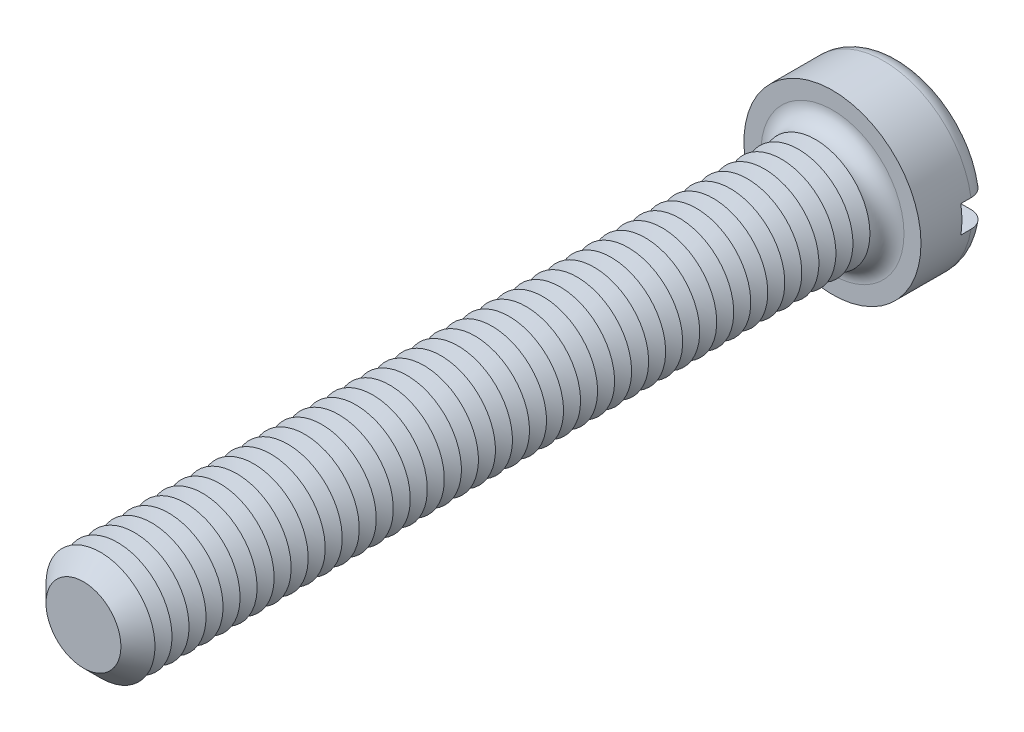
from build123d import *

# Parameters (mm, degrees)
SKETCH3_R           = 6.5
BOSS_EXTRUDE2_DEPTH = 5
SKETCH4_R           = 4
BOSS_EXTRUDE3_DEPTH = 55
FILLET1_R           = 1.25
CHAMFER1_SIZE       = 1.25
LPATTERN1_COUNT     = 42
LPATTERN1_PITCH     = 1.25
SKETCH8_W           = 13
SKETCH8_H           = 2
CUT_EXTRUDE1_DEPTH  = 2


with BuildPart() as part:
    # Sketch3 → Boss-Extrude2 (new body)
    with BuildSketch(Plane.XY):
        Circle(SKETCH3_R)
    extrude(amount=-BOSS_EXTRUDE2_DEPTH)

    # Sketch4 → Boss-Extrude3 (add)
    with BuildSketch(Plane.XY):
        Circle(SKETCH4_R)
    extrude(amount=BOSS_EXTRUDE3_DEPTH)

    # Fillet1
    fillet1_edges = [part.edges().sort_by_distance(p)[0] for p in [
        (-6.5, 0, -5),
        (-4, 0, 0),
    ]]
    fillet(fillet1_edges, radius=FILLET1_R)

    # Chamfer1
    chamfer1_edges = [part.edges().sort_by_distance(p)[0] for p in [
        (-4, 0, 55),
    ]]
    chamfer(chamfer1_edges, length=CHAMFER1_SIZE)

    # Sketch6 → Cut-Revolve1 (revolve, cut)
    with BuildSketch(Plane(origin=(0, 0, 0), x_dir=(0, 0, -1), z_dir=(1, 0, 0)), mode=Mode.PRIVATE) as cut_revolve1_sk:
        Polygon((-1.25, 4), (-1.875, 2.917468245), (-2.5, 4), align=None)
    cut_revolve1 = revolve(cut_revolve1_sk.sketch.rotate(Axis((0, 0, -1.694361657), (0, 0, 1)), 90), axis=Axis((0, 0, -1.694361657), (0, 0, 1)), mode=Mode.SUBTRACT)

    # LPattern1: Cut-Revolve1 ×42
    with Locations(*[(0, 0, i * LPATTERN1_PITCH) for i in range(1, LPATTERN1_COUNT)]):
        add(cut_revolve1, mode=Mode.SUBTRACT)

    # Sketch8 → Cut-Extrude1 (cut)
    with BuildSketch(Plane(origin=(0, 0, -5), x_dir=(-1, 0, 0), z_dir=(0, 0, -1))):
        Rectangle(SKETCH8_W, SKETCH8_H)
    extrude(amount=-CUT_EXTRUDE1_DEPTH, mode=Mode.SUBTRACT)


solid = part.part
